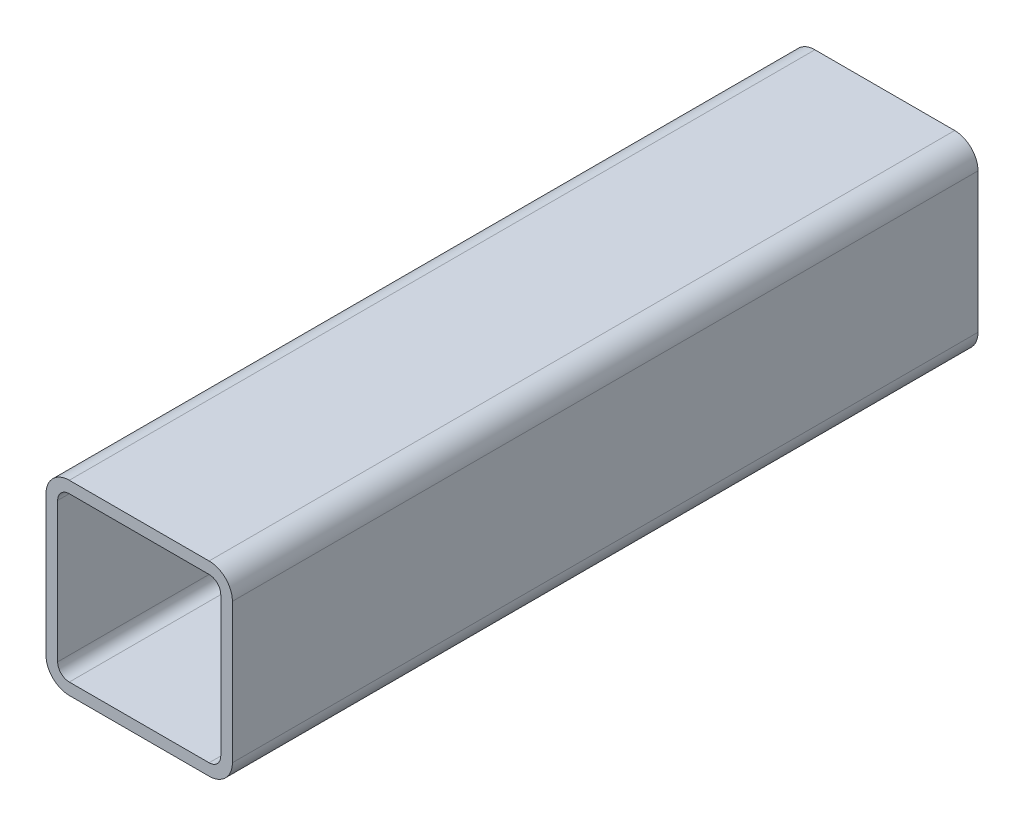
ISO-10303-21;
HEADER;
FILE_DESCRIPTION(('STEP AP214'),'2;1');
FILE_NAME('part.step','',(''),(''),'','','');
FILE_SCHEMA(('AUTOMOTIVE_DESIGN { 1 0 10303 214 1 1 1 1 }'));
ENDSEC;
DATA;
#1=APPLICATION_CONTEXT('core data for automotive mechanical design processes');
#2=APPLICATION_PROTOCOL_DEFINITION('international standard','automotive_design',2000,#1);
#3=PRODUCT_CONTEXT('',#1,'mechanical');
#4=PRODUCT('Part','Part','',(#3));
#5=PRODUCT_RELATED_PRODUCT_CATEGORY('part','',(#4));
#6=PRODUCT_DEFINITION_FORMATION('','',#4);
#7=PRODUCT_DEFINITION_CONTEXT('part definition',#1,'design');
#8=PRODUCT_DEFINITION('design','',#6,#7);
#9=PRODUCT_DEFINITION_SHAPE('','',#8);
#10=(LENGTH_UNIT() NAMED_UNIT(*) SI_UNIT(.MILLI.,.METRE.));
#11=(NAMED_UNIT(*) PLANE_ANGLE_UNIT() SI_UNIT($,.RADIAN.));
#12=(NAMED_UNIT(*) SI_UNIT($,.STERADIAN.) SOLID_ANGLE_UNIT());
#13=UNCERTAINTY_MEASURE_WITH_UNIT(LENGTH_MEASURE(1.E-05),#10,'distance_accuracy_value','');
#14=(GEOMETRIC_REPRESENTATION_CONTEXT(3) GLOBAL_UNCERTAINTY_ASSIGNED_CONTEXT((#13)) GLOBAL_UNIT_ASSIGNED_CONTEXT((#10,
#11,#12)) REPRESENTATION_CONTEXT('',''));
#15=CARTESIAN_POINT('',(0.,0.,0.));
#16=DIRECTION('',(0.,0.,1.));
#17=DIRECTION('',(1.,0.,0.));
#18=AXIS2_PLACEMENT_3D('',#15,#16,#17);
#19=CARTESIAN_POINT('',(12.0141160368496,68.7556737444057,304.8));
#20=DIRECTION('',(0.,0.,1.));
#21=DIRECTION('',(1.,0.,0.));
#22=AXIS2_PLACEMENT_3D('',#19,#20,#21);
#23=PLANE('',#22);
#24=CARTESIAN_POINT('',(12.0141160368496,68.7556737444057,304.8));
#25=DIRECTION('',(0.,0.,1.));
#26=DIRECTION('',(1.,0.,0.));
#27=AXIS2_PLACEMENT_3D('',#24,#25,#26);
#28=CIRCLE('',#27,9.525);
#29=CARTESIAN_POINT('',(12.0141160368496,78.2806737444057,304.8));
#30=VERTEX_POINT('',#29);
#31=CARTESIAN_POINT('',(2.48911603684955,68.7556737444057,304.8));
#32=VERTEX_POINT('',#31);
#33=EDGE_CURVE('E211',#30,#32,#28,.T.);
#34=ORIENTED_EDGE('',*,*,#33,.T.);
#35=DIRECTION('',(0.,-1.,0.));
#36=VECTOR('',#35,1.);
#37=CARTESIAN_POINT('',(2.48911603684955,11.6056737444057,304.8));
#38=LINE('',#37,#36);
#39=CARTESIAN_POINT('',(2.48911603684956,11.6056737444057,304.8));
#40=VERTEX_POINT('',#39);
#41=EDGE_CURVE('E214',#32,#40,#38,.T.);
#42=ORIENTED_EDGE('',*,*,#41,.T.);
#43=CARTESIAN_POINT('',(12.0141160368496,11.6056737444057,304.8));
#44=DIRECTION('',(0.,0.,1.));
#45=DIRECTION('',(1.,0.,0.));
#46=AXIS2_PLACEMENT_3D('',#43,#44,#45);
#47=CIRCLE('',#46,9.525);
#48=CARTESIAN_POINT('',(12.0141160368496,2.0806737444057,304.8));
#49=VERTEX_POINT('',#48);
#50=EDGE_CURVE('E217',#40,#49,#47,.T.);
#51=ORIENTED_EDGE('',*,*,#50,.T.);
#52=DIRECTION('',(1.,0.,0.));
#53=VECTOR('',#52,1.);
#54=CARTESIAN_POINT('',(69.1641160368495,2.0806737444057,304.8));
#55=LINE('',#54,#53);
#56=CARTESIAN_POINT('',(69.1641160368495,2.08067374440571,304.8));
#57=VERTEX_POINT('',#56);
#58=EDGE_CURVE('E219',#49,#57,#55,.T.);
#59=ORIENTED_EDGE('',*,*,#58,.T.);
#60=CARTESIAN_POINT('',(69.1641160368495,11.6056737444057,304.8));
#61=DIRECTION('',(0.,0.,1.));
#62=DIRECTION('',(1.,0.,0.));
#63=AXIS2_PLACEMENT_3D('',#60,#61,#62);
#64=CIRCLE('',#63,9.525);
#65=CARTESIAN_POINT('',(78.6891160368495,11.6056737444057,304.8));
#66=VERTEX_POINT('',#65);
#67=EDGE_CURVE('E221',#57,#66,#64,.T.);
#68=ORIENTED_EDGE('',*,*,#67,.T.);
#69=DIRECTION('',(0.,1.,0.));
#70=VECTOR('',#69,1.);
#71=CARTESIAN_POINT('',(78.6891160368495,68.7556737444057,304.8));
#72=LINE('',#71,#70);
#73=CARTESIAN_POINT('',(78.6891160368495,68.7556737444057,304.8));
#74=VERTEX_POINT('',#73);
#75=EDGE_CURVE('E223',#66,#74,#72,.T.);
#76=ORIENTED_EDGE('',*,*,#75,.T.);
#77=CARTESIAN_POINT('',(69.1641160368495,68.7556737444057,304.8));
#78=DIRECTION('',(0.,0.,1.));
#79=DIRECTION('',(1.,0.,0.));
#80=AXIS2_PLACEMENT_3D('',#77,#78,#79);
#81=CIRCLE('',#80,9.52499999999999);
#82=CARTESIAN_POINT('',(69.1641160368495,78.2806737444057,304.8));
#83=VERTEX_POINT('',#82);
#84=EDGE_CURVE('E225',#74,#83,#81,.T.);
#85=ORIENTED_EDGE('',*,*,#84,.T.);
#86=DIRECTION('',(-1.,0.,0.));
#87=VECTOR('',#86,1.);
#88=CARTESIAN_POINT('',(12.0141160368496,78.2806737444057,304.8));
#89=LINE('',#88,#87);
#90=EDGE_CURVE('E227',#83,#30,#89,.T.);
#91=ORIENTED_EDGE('',*,*,#90,.T.);
#92=EDGE_LOOP('',(#34,#42,#51,#59,#68,#76,#85,#91));
#93=FACE_BOUND('',#92,.T.);
#94=DIRECTION('',(0.,-1.,0.));
#95=VECTOR('',#94,1.);
#96=CARTESIAN_POINT('',(7.25161603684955,11.6056737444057,304.8));
#97=LINE('',#96,#95);
#98=CARTESIAN_POINT('',(7.25161603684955,68.7556737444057,304.8));
#99=VERTEX_POINT('',#98);
#100=CARTESIAN_POINT('',(7.25161603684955,11.6056737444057,304.8));
#101=VERTEX_POINT('',#100);
#102=EDGE_CURVE('E154',#99,#101,#97,.T.);
#103=ORIENTED_EDGE('',*,*,#102,.F.);
#104=CARTESIAN_POINT('',(12.0141160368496,68.7556737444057,304.8));
#105=DIRECTION('',(0.,0.,1.));
#106=DIRECTION('',(1.,0.,0.));
#107=AXIS2_PLACEMENT_3D('',#104,#105,#106);
#108=CIRCLE('',#107,4.76249999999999);
#109=CARTESIAN_POINT('',(12.0141160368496,73.5181737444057,304.8));
#110=VERTEX_POINT('',#109);
#111=EDGE_CURVE('E146',#110,#99,#108,.T.);
#112=ORIENTED_EDGE('',*,*,#111,.F.);
#113=DIRECTION('',(-1.,0.,0.));
#114=VECTOR('',#113,1.);
#115=CARTESIAN_POINT('',(12.0141160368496,73.5181737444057,304.8));
#116=LINE('',#115,#114);
#117=CARTESIAN_POINT('',(69.1641160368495,73.5181737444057,304.8));
#118=VERTEX_POINT('',#117);
#119=EDGE_CURVE('E179',#118,#110,#116,.T.);
#120=ORIENTED_EDGE('',*,*,#119,.F.);
#121=CARTESIAN_POINT('',(69.1641160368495,68.7556737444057,304.8));
#122=DIRECTION('',(0.,0.,1.));
#123=DIRECTION('',(1.,0.,0.));
#124=AXIS2_PLACEMENT_3D('',#121,#122,#123);
#125=CIRCLE('',#124,4.7625);
#126=CARTESIAN_POINT('',(73.9266160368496,68.7556737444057,304.8));
#127=VERTEX_POINT('',#126);
#128=EDGE_CURVE('E177',#127,#118,#125,.T.);
#129=ORIENTED_EDGE('',*,*,#128,.F.);
#130=DIRECTION('',(0.,1.,0.));
#131=VECTOR('',#130,1.);
#132=CARTESIAN_POINT('',(73.9266160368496,68.7556737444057,304.8));
#133=LINE('',#132,#131);
#134=CARTESIAN_POINT('',(73.9266160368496,11.6056737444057,304.8));
#135=VERTEX_POINT('',#134);
#136=EDGE_CURVE('E175',#135,#127,#133,.T.);
#137=ORIENTED_EDGE('',*,*,#136,.F.);
#138=CARTESIAN_POINT('',(69.1641160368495,11.6056737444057,304.8));
#139=DIRECTION('',(0.,0.,1.));
#140=DIRECTION('',(1.,0.,0.));
#141=AXIS2_PLACEMENT_3D('',#138,#139,#140);
#142=CIRCLE('',#141,4.7625);
#143=CARTESIAN_POINT('',(69.1641160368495,6.8431737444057,304.8));
#144=VERTEX_POINT('',#143);
#145=EDGE_CURVE('E173',#144,#135,#142,.T.);
#146=ORIENTED_EDGE('',*,*,#145,.F.);
#147=DIRECTION('',(1.,0.,0.));
#148=VECTOR('',#147,1.);
#149=CARTESIAN_POINT('',(69.1641160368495,6.8431737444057,304.8));
#150=LINE('',#149,#148);
#151=CARTESIAN_POINT('',(12.0141160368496,6.8431737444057,304.8));
#152=VERTEX_POINT('',#151);
#153=EDGE_CURVE('E169',#152,#144,#150,.T.);
#154=ORIENTED_EDGE('',*,*,#153,.F.);
#155=CARTESIAN_POINT('',(12.0141160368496,11.6056737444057,304.8));
#156=DIRECTION('',(0.,0.,1.));
#157=DIRECTION('',(1.,0.,0.));
#158=AXIS2_PLACEMENT_3D('',#155,#156,#157);
#159=CIRCLE('',#158,4.7625);
#160=EDGE_CURVE('E167',#101,#152,#159,.T.);
#161=ORIENTED_EDGE('',*,*,#160,.F.);
#162=EDGE_LOOP('',(#103,#112,#120,#129,#137,#146,#154,#161));
#163=FACE_BOUND('',#162,.T.);
#164=ADVANCED_FACE('F33',(#93,#163),#23,.T.);
#165=CARTESIAN_POINT('',(12.0141160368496,68.7556737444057,0.));
#166=DIRECTION('',(0.,0.,1.));
#167=DIRECTION('',(1.,0.,0.));
#168=AXIS2_PLACEMENT_3D('',#165,#166,#167);
#169=PLANE('',#168);
#170=CARTESIAN_POINT('',(12.0141160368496,68.7556737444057,0.));
#171=DIRECTION('',(0.,0.,1.));
#172=DIRECTION('',(1.,0.,0.));
#173=AXIS2_PLACEMENT_3D('',#170,#171,#172);
#174=CIRCLE('',#173,9.525);
#175=CARTESIAN_POINT('',(12.0141160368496,78.2806737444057,0.));
#176=VERTEX_POINT('',#175);
#177=CARTESIAN_POINT('',(2.48911603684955,68.7556737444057,0.));
#178=VERTEX_POINT('',#177);
#179=EDGE_CURVE('E162',#176,#178,#174,.T.);
#180=ORIENTED_EDGE('',*,*,#179,.F.);
#181=DIRECTION('',(-1.,0.,0.));
#182=VECTOR('',#181,1.);
#183=CARTESIAN_POINT('',(12.0141160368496,78.2806737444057,0.));
#184=LINE('',#183,#182);
#185=CARTESIAN_POINT('',(69.1641160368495,78.2806737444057,0.));
#186=VERTEX_POINT('',#185);
#187=EDGE_CURVE('E215',#186,#176,#184,.T.);
#188=ORIENTED_EDGE('',*,*,#187,.F.);
#189=CARTESIAN_POINT('',(69.1641160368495,68.7556737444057,0.));
#190=DIRECTION('',(0.,0.,1.));
#191=DIRECTION('',(1.,0.,0.));
#192=AXIS2_PLACEMENT_3D('',#189,#190,#191);
#193=CIRCLE('',#192,9.52499999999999);
#194=CARTESIAN_POINT('',(78.6891160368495,68.7556737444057,0.));
#195=VERTEX_POINT('',#194);
#196=EDGE_CURVE('E242',#195,#186,#193,.T.);
#197=ORIENTED_EDGE('',*,*,#196,.F.);
#198=DIRECTION('',(0.,1.,0.));
#199=VECTOR('',#198,1.);
#200=CARTESIAN_POINT('',(78.6891160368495,68.7556737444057,0.));
#201=LINE('',#200,#199);
#202=CARTESIAN_POINT('',(78.6891160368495,11.6056737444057,0.));
#203=VERTEX_POINT('',#202);
#204=EDGE_CURVE('E240',#203,#195,#201,.T.);
#205=ORIENTED_EDGE('',*,*,#204,.F.);
#206=CARTESIAN_POINT('',(69.1641160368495,11.6056737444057,0.));
#207=DIRECTION('',(0.,0.,1.));
#208=DIRECTION('',(1.,0.,0.));
#209=AXIS2_PLACEMENT_3D('',#206,#207,#208);
#210=CIRCLE('',#209,9.525);
#211=CARTESIAN_POINT('',(69.1641160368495,2.08067374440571,0.));
#212=VERTEX_POINT('',#211);
#213=EDGE_CURVE('E238',#212,#203,#210,.T.);
#214=ORIENTED_EDGE('',*,*,#213,.F.);
#215=DIRECTION('',(1.,0.,0.));
#216=VECTOR('',#215,1.);
#217=CARTESIAN_POINT('',(69.1641160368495,2.0806737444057,0.));
#218=LINE('',#217,#216);
#219=CARTESIAN_POINT('',(12.0141160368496,2.0806737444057,0.));
#220=VERTEX_POINT('',#219);
#221=EDGE_CURVE('E236',#220,#212,#218,.T.);
#222=ORIENTED_EDGE('',*,*,#221,.F.);
#223=CARTESIAN_POINT('',(12.0141160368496,11.6056737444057,0.));
#224=DIRECTION('',(0.,0.,1.));
#225=DIRECTION('',(1.,0.,0.));
#226=AXIS2_PLACEMENT_3D('',#223,#224,#225);
#227=CIRCLE('',#226,9.525);
#228=CARTESIAN_POINT('',(2.48911603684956,11.6056737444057,0.));
#229=VERTEX_POINT('',#228);
#230=EDGE_CURVE('E234',#229,#220,#227,.T.);
#231=ORIENTED_EDGE('',*,*,#230,.F.);
#232=DIRECTION('',(0.,-1.,0.));
#233=VECTOR('',#232,1.);
#234=CARTESIAN_POINT('',(2.48911603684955,11.6056737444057,0.));
#235=LINE('',#234,#233);
#236=EDGE_CURVE('E232',#178,#229,#235,.T.);
#237=ORIENTED_EDGE('',*,*,#236,.F.);
#238=EDGE_LOOP('',(#180,#188,#197,#205,#214,#222,#231,#237));
#239=FACE_BOUND('',#238,.T.);
#240=CARTESIAN_POINT('',(12.0141160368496,68.7556737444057,0.));
#241=DIRECTION('',(0.,0.,1.));
#242=DIRECTION('',(1.,0.,0.));
#243=AXIS2_PLACEMENT_3D('',#240,#241,#242);
#244=CIRCLE('',#243,4.76249999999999);
#245=CARTESIAN_POINT('',(12.0141160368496,73.5181737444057,0.));
#246=VERTEX_POINT('',#245);
#247=CARTESIAN_POINT('',(7.25161603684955,68.7556737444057,0.));
#248=VERTEX_POINT('',#247);
#249=EDGE_CURVE('E56',#246,#248,#244,.T.);
#250=ORIENTED_EDGE('',*,*,#249,.T.);
#251=DIRECTION('',(0.,-1.,0.));
#252=VECTOR('',#251,1.);
#253=CARTESIAN_POINT('',(7.25161603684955,11.6056737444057,0.));
#254=LINE('',#253,#252);
#255=CARTESIAN_POINT('',(7.25161603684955,11.6056737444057,0.));
#256=VERTEX_POINT('',#255);
#257=EDGE_CURVE('E161',#248,#256,#254,.T.);
#258=ORIENTED_EDGE('',*,*,#257,.T.);
#259=CARTESIAN_POINT('',(12.0141160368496,11.6056737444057,0.));
#260=DIRECTION('',(0.,0.,1.));
#261=DIRECTION('',(1.,0.,0.));
#262=AXIS2_PLACEMENT_3D('',#259,#260,#261);
#263=CIRCLE('',#262,4.7625);
#264=CARTESIAN_POINT('',(12.0141160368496,6.8431737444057,0.));
#265=VERTEX_POINT('',#264);
#266=EDGE_CURVE('E183',#256,#265,#263,.T.);
#267=ORIENTED_EDGE('',*,*,#266,.T.);
#268=DIRECTION('',(1.,0.,0.));
#269=VECTOR('',#268,1.);
#270=CARTESIAN_POINT('',(69.1641160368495,6.8431737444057,0.));
#271=LINE('',#270,#269);
#272=CARTESIAN_POINT('',(69.1641160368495,6.8431737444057,0.));
#273=VERTEX_POINT('',#272);
#274=EDGE_CURVE('E186',#265,#273,#271,.T.);
#275=ORIENTED_EDGE('',*,*,#274,.T.);
#276=CARTESIAN_POINT('',(69.1641160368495,11.6056737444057,0.));
#277=DIRECTION('',(0.,0.,1.));
#278=DIRECTION('',(1.,0.,0.));
#279=AXIS2_PLACEMENT_3D('',#276,#277,#278);
#280=CIRCLE('',#279,4.7625);
#281=CARTESIAN_POINT('',(73.9266160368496,11.6056737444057,0.));
#282=VERTEX_POINT('',#281);
#283=EDGE_CURVE('E189',#273,#282,#280,.T.);
#284=ORIENTED_EDGE('',*,*,#283,.T.);
#285=DIRECTION('',(0.,1.,0.));
#286=VECTOR('',#285,1.);
#287=CARTESIAN_POINT('',(73.9266160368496,68.7556737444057,0.));
#288=LINE('',#287,#286);
#289=CARTESIAN_POINT('',(73.9266160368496,68.7556737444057,0.));
#290=VERTEX_POINT('',#289);
#291=EDGE_CURVE('E192',#282,#290,#288,.T.);
#292=ORIENTED_EDGE('',*,*,#291,.T.);
#293=CARTESIAN_POINT('',(69.1641160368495,68.7556737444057,0.));
#294=DIRECTION('',(0.,0.,1.));
#295=DIRECTION('',(1.,0.,0.));
#296=AXIS2_PLACEMENT_3D('',#293,#294,#295);
#297=CIRCLE('',#296,4.7625);
#298=CARTESIAN_POINT('',(69.1641160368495,73.5181737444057,0.));
#299=VERTEX_POINT('',#298);
#300=EDGE_CURVE('E195',#290,#299,#297,.T.);
#301=ORIENTED_EDGE('',*,*,#300,.T.);
#302=DIRECTION('',(-1.,0.,0.));
#303=VECTOR('',#302,1.);
#304=CARTESIAN_POINT('',(12.0141160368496,73.5181737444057,0.));
#305=LINE('',#304,#303);
#306=EDGE_CURVE('E155',#299,#246,#305,.T.);
#307=ORIENTED_EDGE('',*,*,#306,.T.);
#308=EDGE_LOOP('',(#250,#258,#267,#275,#284,#292,#301,#307));
#309=FACE_BOUND('',#308,.T.);
#310=ADVANCED_FACE('F272',(#239,#309),#169,.F.);
#311=CARTESIAN_POINT('',(12.0141160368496,68.7556737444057,304.8));
#312=DIRECTION('',(0.,0.,-1.));
#313=DIRECTION('',(-1.,0.,0.));
#314=AXIS2_PLACEMENT_3D('',#311,#312,#313);
#315=CYLINDRICAL_SURFACE('',#314,9.525);
#316=ORIENTED_EDGE('',*,*,#179,.T.);
#317=DIRECTION('',(0.,0.,-1.));
#318=VECTOR('',#317,1.);
#319=CARTESIAN_POINT('',(2.48911603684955,68.7556737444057,304.8));
#320=LINE('',#319,#318);
#321=EDGE_CURVE('E11',#32,#178,#320,.T.);
#322=ORIENTED_EDGE('',*,*,#321,.F.);
#323=ORIENTED_EDGE('',*,*,#33,.F.);
#324=DIRECTION('',(0.,0.,-1.));
#325=VECTOR('',#324,1.);
#326=CARTESIAN_POINT('',(12.0141160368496,78.2806737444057,304.8));
#327=LINE('',#326,#325);
#328=EDGE_CURVE('E229',#30,#176,#327,.T.);
#329=ORIENTED_EDGE('',*,*,#328,.T.);
#330=EDGE_LOOP('',(#316,#322,#323,#329));
#331=FACE_BOUND('',#330,.T.);
#332=ADVANCED_FACE('F35',(#331),#315,.T.);
#333=CARTESIAN_POINT('',(2.48911603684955,11.6056737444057,304.8));
#334=DIRECTION('',(1.,0.,0.));
#335=DIRECTION('',(0.,0.,-1.));
#336=AXIS2_PLACEMENT_3D('',#333,#334,#335);
#337=PLANE('',#336);
#338=ORIENTED_EDGE('',*,*,#236,.T.);
#339=DIRECTION('',(0.,0.,-1.));
#340=VECTOR('',#339,1.);
#341=CARTESIAN_POINT('',(2.48911603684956,11.6056737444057,304.8));
#342=LINE('',#341,#340);
#343=EDGE_CURVE('E41',#40,#229,#342,.T.);
#344=ORIENTED_EDGE('',*,*,#343,.F.);
#345=ORIENTED_EDGE('',*,*,#41,.F.);
#346=ORIENTED_EDGE('',*,*,#321,.T.);
#347=EDGE_LOOP('',(#338,#344,#345,#346));
#348=FACE_BOUND('',#347,.T.);
#349=ADVANCED_FACE('F289',(#348),#337,.F.);
#350=CARTESIAN_POINT('',(12.0141160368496,11.6056737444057,304.8));
#351=DIRECTION('',(0.,0.,-1.));
#352=DIRECTION('',(-1.,0.,0.));
#353=AXIS2_PLACEMENT_3D('',#350,#351,#352);
#354=CYLINDRICAL_SURFACE('',#353,9.525);
#355=ORIENTED_EDGE('',*,*,#230,.T.);
#356=DIRECTION('',(0.,0.,-1.));
#357=VECTOR('',#356,1.);
#358=CARTESIAN_POINT('',(12.0141160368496,2.0806737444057,304.8));
#359=LINE('',#358,#357);
#360=EDGE_CURVE('E259',#49,#220,#359,.T.);
#361=ORIENTED_EDGE('',*,*,#360,.F.);
#362=ORIENTED_EDGE('',*,*,#50,.F.);
#363=ORIENTED_EDGE('',*,*,#343,.T.);
#364=EDGE_LOOP('',(#355,#361,#362,#363));
#365=FACE_BOUND('',#364,.T.);
#366=ADVANCED_FACE('F266',(#365),#354,.T.);
#367=CARTESIAN_POINT('',(69.1641160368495,2.0806737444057,304.8));
#368=DIRECTION('',(0.,1.,0.));
#369=DIRECTION('',(0.,0.,1.));
#370=AXIS2_PLACEMENT_3D('',#367,#368,#369);
#371=PLANE('',#370);
#372=ORIENTED_EDGE('',*,*,#221,.T.);
#373=DIRECTION('',(0.,0.,-1.));
#374=VECTOR('',#373,1.);
#375=CARTESIAN_POINT('',(69.1641160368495,2.08067374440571,304.8));
#376=LINE('',#375,#374);
#377=EDGE_CURVE('E256',#57,#212,#376,.T.);
#378=ORIENTED_EDGE('',*,*,#377,.F.);
#379=ORIENTED_EDGE('',*,*,#58,.F.);
#380=ORIENTED_EDGE('',*,*,#360,.T.);
#381=EDGE_LOOP('',(#372,#378,#379,#380));
#382=FACE_BOUND('',#381,.T.);
#383=ADVANCED_FACE('F278',(#382),#371,.F.);
#384=CARTESIAN_POINT('',(69.1641160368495,11.6056737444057,304.8));
#385=DIRECTION('',(0.,0.,-1.));
#386=DIRECTION('',(-1.,0.,0.));
#387=AXIS2_PLACEMENT_3D('',#384,#385,#386);
#388=CYLINDRICAL_SURFACE('',#387,9.525);
#389=ORIENTED_EDGE('',*,*,#213,.T.);
#390=DIRECTION('',(0.,0.,-1.));
#391=VECTOR('',#390,1.);
#392=CARTESIAN_POINT('',(78.6891160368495,11.6056737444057,304.8));
#393=LINE('',#392,#391);
#394=EDGE_CURVE('E253',#66,#203,#393,.T.);
#395=ORIENTED_EDGE('',*,*,#394,.F.);
#396=ORIENTED_EDGE('',*,*,#67,.F.);
#397=ORIENTED_EDGE('',*,*,#377,.T.);
#398=EDGE_LOOP('',(#389,#395,#396,#397));
#399=FACE_BOUND('',#398,.T.);
#400=ADVANCED_FACE('F282',(#399),#388,.T.);
#401=CARTESIAN_POINT('',(78.6891160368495,68.7556737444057,304.8));
#402=DIRECTION('',(-1.,0.,0.));
#403=DIRECTION('',(0.,0.,1.));
#404=AXIS2_PLACEMENT_3D('',#401,#402,#403);
#405=PLANE('',#404);
#406=ORIENTED_EDGE('',*,*,#204,.T.);
#407=DIRECTION('',(0.,0.,-1.));
#408=VECTOR('',#407,1.);
#409=CARTESIAN_POINT('',(78.6891160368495,68.7556737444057,304.8));
#410=LINE('',#409,#408);
#411=EDGE_CURVE('E250',#74,#195,#410,.T.);
#412=ORIENTED_EDGE('',*,*,#411,.F.);
#413=ORIENTED_EDGE('',*,*,#75,.F.);
#414=ORIENTED_EDGE('',*,*,#394,.T.);
#415=EDGE_LOOP('',(#406,#412,#413,#414));
#416=FACE_BOUND('',#415,.T.);
#417=ADVANCED_FACE('F302',(#416),#405,.F.);
#418=CARTESIAN_POINT('',(69.1641160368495,68.7556737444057,304.8));
#419=DIRECTION('',(0.,0.,-1.));
#420=DIRECTION('',(-1.,0.,0.));
#421=AXIS2_PLACEMENT_3D('',#418,#419,#420);
#422=CYLINDRICAL_SURFACE('',#421,9.52499999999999);
#423=ORIENTED_EDGE('',*,*,#196,.T.);
#424=DIRECTION('',(0.,0.,-1.));
#425=VECTOR('',#424,1.);
#426=CARTESIAN_POINT('',(69.1641160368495,78.2806737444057,304.8));
#427=LINE('',#426,#425);
#428=EDGE_CURVE('E247',#83,#186,#427,.T.);
#429=ORIENTED_EDGE('',*,*,#428,.F.);
#430=ORIENTED_EDGE('',*,*,#84,.F.);
#431=ORIENTED_EDGE('',*,*,#411,.T.);
#432=EDGE_LOOP('',(#423,#429,#430,#431));
#433=FACE_BOUND('',#432,.T.);
#434=ADVANCED_FACE('F300',(#433),#422,.T.);
#435=CARTESIAN_POINT('',(12.0141160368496,78.2806737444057,304.8));
#436=DIRECTION('',(0.,-1.,0.));
#437=DIRECTION('',(0.,0.,-1.));
#438=AXIS2_PLACEMENT_3D('',#435,#436,#437);
#439=PLANE('',#438);
#440=ORIENTED_EDGE('',*,*,#187,.T.);
#441=ORIENTED_EDGE('',*,*,#328,.F.);
#442=ORIENTED_EDGE('',*,*,#90,.F.);
#443=ORIENTED_EDGE('',*,*,#428,.T.);
#444=EDGE_LOOP('',(#440,#441,#442,#443));
#445=FACE_BOUND('',#444,.T.);
#446=ADVANCED_FACE('F295',(#445),#439,.F.);
#447=CARTESIAN_POINT('',(12.0141160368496,68.7556737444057,304.8));
#448=DIRECTION('',(0.,0.,-1.));
#449=DIRECTION('',(-1.,0.,0.));
#450=AXIS2_PLACEMENT_3D('',#447,#448,#449);
#451=CYLINDRICAL_SURFACE('',#450,4.76249999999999);
#452=ORIENTED_EDGE('',*,*,#249,.F.);
#453=DIRECTION('',(0.,0.,-1.));
#454=VECTOR('',#453,1.);
#455=CARTESIAN_POINT('',(12.0141160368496,73.5181737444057,304.8));
#456=LINE('',#455,#454);
#457=EDGE_CURVE('E150',#110,#246,#456,.T.);
#458=ORIENTED_EDGE('',*,*,#457,.F.);
#459=ORIENTED_EDGE('',*,*,#111,.T.);
#460=DIRECTION('',(0.,0.,-1.));
#461=VECTOR('',#460,1.);
#462=CARTESIAN_POINT('',(7.25161603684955,68.7556737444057,304.8));
#463=LINE('',#462,#461);
#464=EDGE_CURVE('E149',#99,#248,#463,.T.);
#465=ORIENTED_EDGE('',*,*,#464,.T.);
#466=EDGE_LOOP('',(#452,#458,#459,#465));
#467=FACE_BOUND('',#466,.T.);
#468=ADVANCED_FACE('F148',(#467),#451,.F.);
#469=CARTESIAN_POINT('',(7.25161603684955,11.6056737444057,304.8));
#470=DIRECTION('',(1.,0.,0.));
#471=DIRECTION('',(0.,0.,-1.));
#472=AXIS2_PLACEMENT_3D('',#469,#470,#471);
#473=PLANE('',#472);
#474=ORIENTED_EDGE('',*,*,#257,.F.);
#475=ORIENTED_EDGE('',*,*,#464,.F.);
#476=ORIENTED_EDGE('',*,*,#102,.T.);
#477=DIRECTION('',(0.,0.,-1.));
#478=VECTOR('',#477,1.);
#479=CARTESIAN_POINT('',(7.25161603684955,11.6056737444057,304.8));
#480=LINE('',#479,#478);
#481=EDGE_CURVE('E163',#101,#256,#480,.T.);
#482=ORIENTED_EDGE('',*,*,#481,.T.);
#483=EDGE_LOOP('',(#474,#475,#476,#482));
#484=FACE_BOUND('',#483,.T.);
#485=ADVANCED_FACE('F158',(#484),#473,.T.);
#486=CARTESIAN_POINT('',(12.0141160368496,11.6056737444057,304.8));
#487=DIRECTION('',(0.,0.,-1.));
#488=DIRECTION('',(-1.,0.,0.));
#489=AXIS2_PLACEMENT_3D('',#486,#487,#488);
#490=CYLINDRICAL_SURFACE('',#489,4.7625);
#491=ORIENTED_EDGE('',*,*,#266,.F.);
#492=ORIENTED_EDGE('',*,*,#481,.F.);
#493=ORIENTED_EDGE('',*,*,#160,.T.);
#494=DIRECTION('',(0.,0.,-1.));
#495=VECTOR('',#494,1.);
#496=CARTESIAN_POINT('',(12.0141160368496,6.8431737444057,304.8));
#497=LINE('',#496,#495);
#498=EDGE_CURVE('E208',#152,#265,#497,.T.);
#499=ORIENTED_EDGE('',*,*,#498,.T.);
#500=EDGE_LOOP('',(#491,#492,#493,#499));
#501=FACE_BOUND('',#500,.T.);
#502=ADVANCED_FACE('F327',(#501),#490,.F.);
#503=CARTESIAN_POINT('',(69.1641160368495,6.8431737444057,304.8));
#504=DIRECTION('',(0.,1.,0.));
#505=DIRECTION('',(0.,0.,1.));
#506=AXIS2_PLACEMENT_3D('',#503,#504,#505);
#507=PLANE('',#506);
#508=ORIENTED_EDGE('',*,*,#274,.F.);
#509=ORIENTED_EDGE('',*,*,#498,.F.);
#510=ORIENTED_EDGE('',*,*,#153,.T.);
#511=DIRECTION('',(0.,0.,-1.));
#512=VECTOR('',#511,1.);
#513=CARTESIAN_POINT('',(69.1641160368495,6.8431737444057,304.8));
#514=LINE('',#513,#512);
#515=EDGE_CURVE('E206',#144,#273,#514,.T.);
#516=ORIENTED_EDGE('',*,*,#515,.T.);
#517=EDGE_LOOP('',(#508,#509,#510,#516));
#518=FACE_BOUND('',#517,.T.);
#519=ADVANCED_FACE('F331',(#518),#507,.T.);
#520=CARTESIAN_POINT('',(69.1641160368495,11.6056737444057,304.8));
#521=DIRECTION('',(0.,0.,-1.));
#522=DIRECTION('',(-1.,0.,0.));
#523=AXIS2_PLACEMENT_3D('',#520,#521,#522);
#524=CYLINDRICAL_SURFACE('',#523,4.7625);
#525=ORIENTED_EDGE('',*,*,#283,.F.);
#526=ORIENTED_EDGE('',*,*,#515,.F.);
#527=ORIENTED_EDGE('',*,*,#145,.T.);
#528=DIRECTION('',(0.,0.,-1.));
#529=VECTOR('',#528,1.);
#530=CARTESIAN_POINT('',(73.9266160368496,11.6056737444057,304.8));
#531=LINE('',#530,#529);
#532=EDGE_CURVE('E204',#135,#282,#531,.T.);
#533=ORIENTED_EDGE('',*,*,#532,.T.);
#534=EDGE_LOOP('',(#525,#526,#527,#533));
#535=FACE_BOUND('',#534,.T.);
#536=ADVANCED_FACE('F337',(#535),#524,.F.);
#537=CARTESIAN_POINT('',(73.9266160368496,68.7556737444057,304.8));
#538=DIRECTION('',(-1.,0.,0.));
#539=DIRECTION('',(0.,0.,1.));
#540=AXIS2_PLACEMENT_3D('',#537,#538,#539);
#541=PLANE('',#540);
#542=ORIENTED_EDGE('',*,*,#291,.F.);
#543=ORIENTED_EDGE('',*,*,#532,.F.);
#544=ORIENTED_EDGE('',*,*,#136,.T.);
#545=DIRECTION('',(0.,0.,-1.));
#546=VECTOR('',#545,1.);
#547=CARTESIAN_POINT('',(73.9266160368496,68.7556737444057,304.8));
#548=LINE('',#547,#546);
#549=EDGE_CURVE('E202',#127,#290,#548,.T.);
#550=ORIENTED_EDGE('',*,*,#549,.T.);
#551=EDGE_LOOP('',(#542,#543,#544,#550));
#552=FACE_BOUND('',#551,.T.);
#553=ADVANCED_FACE('F341',(#552),#541,.T.);
#554=CARTESIAN_POINT('',(69.1641160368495,68.7556737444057,304.8));
#555=DIRECTION('',(0.,0.,-1.));
#556=DIRECTION('',(-1.,0.,0.));
#557=AXIS2_PLACEMENT_3D('',#554,#555,#556);
#558=CYLINDRICAL_SURFACE('',#557,4.7625);
#559=ORIENTED_EDGE('',*,*,#300,.F.);
#560=ORIENTED_EDGE('',*,*,#549,.F.);
#561=ORIENTED_EDGE('',*,*,#128,.T.);
#562=DIRECTION('',(0.,0.,-1.));
#563=VECTOR('',#562,1.);
#564=CARTESIAN_POINT('',(69.1641160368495,73.5181737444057,304.8));
#565=LINE('',#564,#563);
#566=EDGE_CURVE('E48',#118,#299,#565,.T.);
#567=ORIENTED_EDGE('',*,*,#566,.T.);
#568=EDGE_LOOP('',(#559,#560,#561,#567));
#569=FACE_BOUND('',#568,.T.);
#570=ADVANCED_FACE('F345',(#569),#558,.F.);
#571=CARTESIAN_POINT('',(12.0141160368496,73.5181737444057,304.8));
#572=DIRECTION('',(0.,-1.,0.));
#573=DIRECTION('',(0.,0.,-1.));
#574=AXIS2_PLACEMENT_3D('',#571,#572,#573);
#575=PLANE('',#574);
#576=ORIENTED_EDGE('',*,*,#306,.F.);
#577=ORIENTED_EDGE('',*,*,#566,.F.);
#578=ORIENTED_EDGE('',*,*,#119,.T.);
#579=ORIENTED_EDGE('',*,*,#457,.T.);
#580=EDGE_LOOP('',(#576,#577,#578,#579));
#581=FACE_BOUND('',#580,.T.);
#582=ADVANCED_FACE('F349',(#581),#575,.T.);
#583=CLOSED_SHELL('',(#164,#310,#332,#349,#366,#383,#400,#417,#434,#446,#468,#485,#502,#519,
#536,#553,#570,#582));
#584=MANIFOLD_SOLID_BREP('B2',#583);
#585=ADVANCED_BREP_SHAPE_REPRESENTATION('',(#18,#584),#14);
#586=SHAPE_DEFINITION_REPRESENTATION(#9,#585);
ENDSEC;
END-ISO-10303-21;
